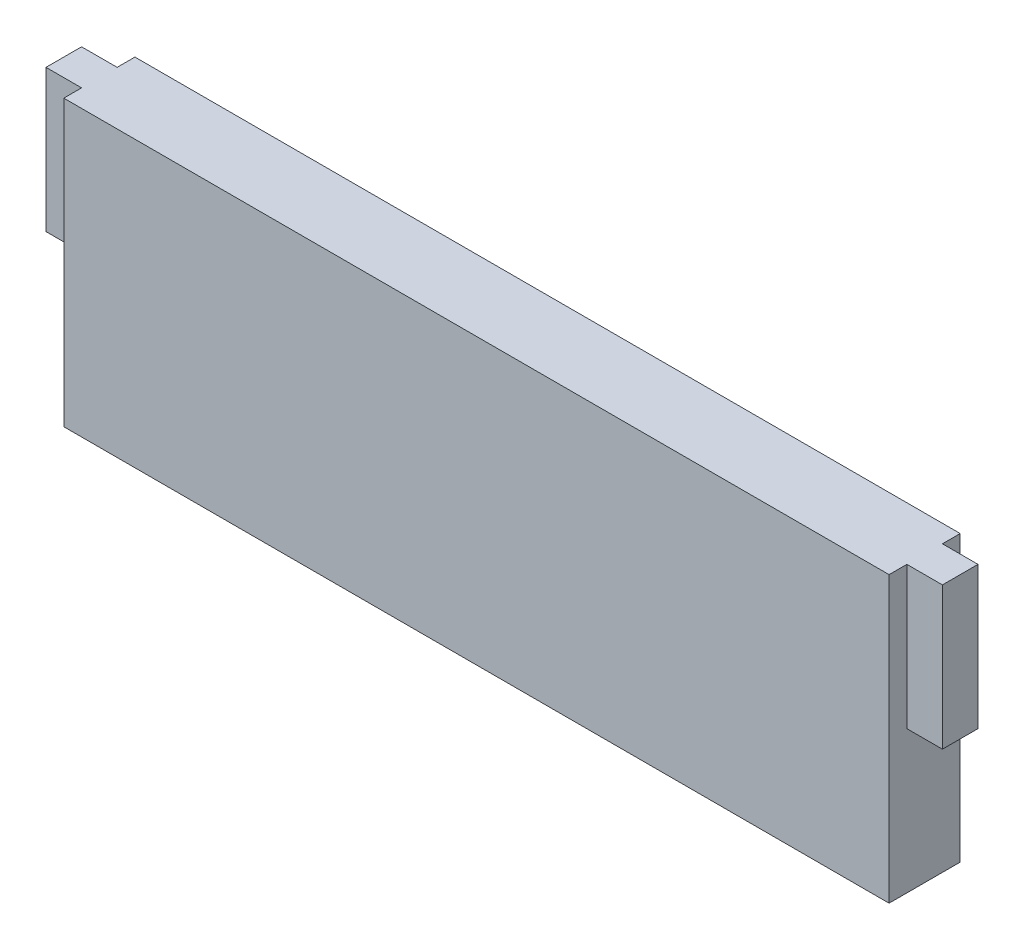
ISO-10303-21;
HEADER;
FILE_DESCRIPTION(('STEP AP214'),'2;1');
FILE_NAME('part.step','',(''),(''),'','','');
FILE_SCHEMA(('AUTOMOTIVE_DESIGN { 1 0 10303 214 1 1 1 1 }'));
ENDSEC;
DATA;
#1=APPLICATION_CONTEXT('core data for automotive mechanical design processes');
#2=APPLICATION_PROTOCOL_DEFINITION('international standard','automotive_design',2000,#1);
#3=PRODUCT_CONTEXT('',#1,'mechanical');
#4=PRODUCT('Part','Part','',(#3));
#5=PRODUCT_RELATED_PRODUCT_CATEGORY('part','',(#4));
#6=PRODUCT_DEFINITION_FORMATION('','',#4);
#7=PRODUCT_DEFINITION_CONTEXT('part definition',#1,'design');
#8=PRODUCT_DEFINITION('design','',#6,#7);
#9=PRODUCT_DEFINITION_SHAPE('','',#8);
#10=(LENGTH_UNIT() NAMED_UNIT(*) SI_UNIT(.MILLI.,.METRE.));
#11=(NAMED_UNIT(*) PLANE_ANGLE_UNIT() SI_UNIT($,.RADIAN.));
#12=(NAMED_UNIT(*) SI_UNIT($,.STERADIAN.) SOLID_ANGLE_UNIT());
#13=UNCERTAINTY_MEASURE_WITH_UNIT(LENGTH_MEASURE(1.E-05),#10,'distance_accuracy_value','');
#14=(GEOMETRIC_REPRESENTATION_CONTEXT(3) GLOBAL_UNCERTAINTY_ASSIGNED_CONTEXT((#13)) GLOBAL_UNIT_ASSIGNED_CONTEXT((#10,
#11,#12)) REPRESENTATION_CONTEXT('',''));
#15=CARTESIAN_POINT('',(0.,0.,0.));
#16=DIRECTION('',(0.,0.,1.));
#17=DIRECTION('',(1.,0.,0.));
#18=AXIS2_PLACEMENT_3D('',#15,#16,#17);
#19=CARTESIAN_POINT('',(58.,0.,-2.5));
#20=DIRECTION('',(1.,0.,0.));
#21=DIRECTION('',(0.,0.,-1.));
#22=AXIS2_PLACEMENT_3D('',#19,#20,#21);
#23=PLANE('',#22);
#24=DIRECTION('',(0.,0.,1.));
#25=VECTOR('',#24,1.);
#26=CARTESIAN_POINT('',(58.,20.212608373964,-1.25));
#27=LINE('',#26,#25);
#28=CARTESIAN_POINT('',(58.,20.212608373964,-1.25));
#29=VERTEX_POINT('',#28);
#30=CARTESIAN_POINT('',(58.,20.212608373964,1.25));
#31=VERTEX_POINT('',#30);
#32=EDGE_CURVE('E60',#29,#31,#27,.T.);
#33=ORIENTED_EDGE('',*,*,#32,.T.);
#34=DIRECTION('',(0.,1.,0.));
#35=VECTOR('',#34,1.);
#36=CARTESIAN_POINT('',(58.,0.,1.25));
#37=LINE('',#36,#35);
#38=CARTESIAN_POINT('',(58.,30.2126083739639,1.25));
#39=VERTEX_POINT('',#38);
#40=EDGE_CURVE('E159',#31,#39,#37,.T.);
#41=ORIENTED_EDGE('',*,*,#40,.T.);
#42=DIRECTION('',(0.,0.,1.));
#43=VECTOR('',#42,1.);
#44=CARTESIAN_POINT('',(58.,30.2126083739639,-2.5));
#45=LINE('',#44,#43);
#46=CARTESIAN_POINT('',(58.,30.2126083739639,2.5));
#47=VERTEX_POINT('',#46);
#48=EDGE_CURVE('E157',#39,#47,#45,.T.);
#49=ORIENTED_EDGE('',*,*,#48,.T.);
#50=DIRECTION('',(0.,1.,0.));
#51=VECTOR('',#50,1.);
#52=CARTESIAN_POINT('',(58.,0.,2.5));
#53=LINE('',#52,#51);
#54=CARTESIAN_POINT('',(58.,10.212608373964,2.5));
#55=VERTEX_POINT('',#54);
#56=EDGE_CURVE('E224',#55,#47,#53,.T.);
#57=ORIENTED_EDGE('',*,*,#56,.F.);
#58=DIRECTION('',(0.,0.,1.));
#59=VECTOR('',#58,1.);
#60=CARTESIAN_POINT('',(58.,10.212608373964,-2.5));
#61=LINE('',#60,#59);
#62=CARTESIAN_POINT('',(58.,10.212608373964,-2.5));
#63=VERTEX_POINT('',#62);
#64=EDGE_CURVE('E46',#63,#55,#61,.T.);
#65=ORIENTED_EDGE('',*,*,#64,.F.);
#66=DIRECTION('',(0.,1.,0.));
#67=VECTOR('',#66,1.);
#68=CARTESIAN_POINT('',(58.,0.,-2.5));
#69=LINE('',#68,#67);
#70=CARTESIAN_POINT('',(58.,30.2126083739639,-2.5));
#71=VERTEX_POINT('',#70);
#72=EDGE_CURVE('E239',#63,#71,#69,.T.);
#73=ORIENTED_EDGE('',*,*,#72,.T.);
#74=CARTESIAN_POINT('',(58.,30.2126083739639,-1.25));
#75=VERTEX_POINT('',#74);
#76=EDGE_CURVE('E251',#71,#75,#45,.T.);
#77=ORIENTED_EDGE('',*,*,#76,.T.);
#78=DIRECTION('',(0.,1.,0.));
#79=VECTOR('',#78,1.);
#80=CARTESIAN_POINT('',(58.,0.,-1.25));
#81=LINE('',#80,#79);
#82=EDGE_CURVE('E65',#29,#75,#81,.T.);
#83=ORIENTED_EDGE('',*,*,#82,.F.);
#84=EDGE_LOOP('',(#33,#41,#49,#57,#65,#73,#77,#83));
#85=FACE_BOUND('',#84,.T.);
#86=ADVANCED_FACE('F42',(#85),#23,.T.);
#87=CARTESIAN_POINT('',(0.,0.,-2.5));
#88=DIRECTION('',(1.,0.,0.));
#89=DIRECTION('',(0.,1.,0.));
#90=AXIS2_PLACEMENT_3D('',#87,#88,#89);
#91=PLANE('',#90);
#92=DIRECTION('',(0.,1.,0.));
#93=VECTOR('',#92,1.);
#94=CARTESIAN_POINT('',(0.,0.,1.25));
#95=LINE('',#94,#93);
#96=CARTESIAN_POINT('',(0.,20.212608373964,1.25));
#97=VERTEX_POINT('',#96);
#98=CARTESIAN_POINT('',(0.,30.212608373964,1.25));
#99=VERTEX_POINT('',#98);
#100=EDGE_CURVE('E185',#97,#99,#95,.T.);
#101=ORIENTED_EDGE('',*,*,#100,.F.);
#102=DIRECTION('',(0.,0.,1.));
#103=VECTOR('',#102,1.);
#104=CARTESIAN_POINT('',(0.,20.212608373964,-1.25));
#105=LINE('',#104,#103);
#106=CARTESIAN_POINT('',(0.,20.212608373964,-1.25));
#107=VERTEX_POINT('',#106);
#108=EDGE_CURVE('E211',#107,#97,#105,.T.);
#109=ORIENTED_EDGE('',*,*,#108,.F.);
#110=DIRECTION('',(0.,1.,0.));
#111=VECTOR('',#110,1.);
#112=CARTESIAN_POINT('',(0.,0.,-1.25));
#113=LINE('',#112,#111);
#114=CARTESIAN_POINT('',(0.,30.212608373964,-1.25));
#115=VERTEX_POINT('',#114);
#116=EDGE_CURVE('E199',#107,#115,#113,.T.);
#117=ORIENTED_EDGE('',*,*,#116,.T.);
#118=DIRECTION('',(0.,0.,1.));
#119=VECTOR('',#118,1.);
#120=CARTESIAN_POINT('',(0.,30.212608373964,-2.5));
#121=LINE('',#120,#119);
#122=CARTESIAN_POINT('',(0.,30.212608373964,-2.5));
#123=VERTEX_POINT('',#122);
#124=EDGE_CURVE('E52',#123,#115,#121,.T.);
#125=ORIENTED_EDGE('',*,*,#124,.F.);
#126=DIRECTION('',(0.,1.,0.));
#127=VECTOR('',#126,1.);
#128=CARTESIAN_POINT('',(0.,0.,-2.5));
#129=LINE('',#128,#127);
#130=CARTESIAN_POINT('',(0.,10.212608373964,-2.5));
#131=VERTEX_POINT('',#130);
#132=EDGE_CURVE('E246',#131,#123,#129,.T.);
#133=ORIENTED_EDGE('',*,*,#132,.F.);
#134=DIRECTION('',(0.,0.,1.));
#135=VECTOR('',#134,1.);
#136=CARTESIAN_POINT('',(0.,10.212608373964,-2.5));
#137=LINE('',#136,#135);
#138=CARTESIAN_POINT('',(0.,10.212608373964,2.5));
#139=VERTEX_POINT('',#138);
#140=EDGE_CURVE('E11',#131,#139,#137,.T.);
#141=ORIENTED_EDGE('',*,*,#140,.T.);
#142=DIRECTION('',(0.,1.,0.));
#143=VECTOR('',#142,1.);
#144=CARTESIAN_POINT('',(0.,0.,2.5));
#145=LINE('',#144,#143);
#146=CARTESIAN_POINT('',(0.,30.212608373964,2.5));
#147=VERTEX_POINT('',#146);
#148=EDGE_CURVE('E231',#139,#147,#145,.T.);
#149=ORIENTED_EDGE('',*,*,#148,.T.);
#150=EDGE_CURVE('E250',#99,#147,#121,.T.);
#151=ORIENTED_EDGE('',*,*,#150,.F.);
#152=EDGE_LOOP('',(#101,#109,#117,#125,#133,#141,#149,#151));
#153=FACE_BOUND('',#152,.T.);
#154=ADVANCED_FACE('F269',(#153),#91,.F.);
#155=CARTESIAN_POINT('',(0.,10.212608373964,-2.5));
#156=DIRECTION('',(0.,-1.,0.));
#157=DIRECTION('',(0.,0.,-1.));
#158=AXIS2_PLACEMENT_3D('',#155,#156,#157);
#159=PLANE('',#158);
#160=ORIENTED_EDGE('',*,*,#64,.T.);
#161=DIRECTION('',(1.,0.,0.));
#162=VECTOR('',#161,1.);
#163=CARTESIAN_POINT('',(0.,10.212608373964,2.5));
#164=LINE('',#163,#162);
#165=EDGE_CURVE('E215',#139,#55,#164,.T.);
#166=ORIENTED_EDGE('',*,*,#165,.F.);
#167=ORIENTED_EDGE('',*,*,#140,.F.);
#168=DIRECTION('',(1.,0.,0.));
#169=VECTOR('',#168,1.);
#170=CARTESIAN_POINT('',(0.,10.212608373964,-2.5));
#171=LINE('',#170,#169);
#172=EDGE_CURVE('E235',#131,#63,#171,.T.);
#173=ORIENTED_EDGE('',*,*,#172,.T.);
#174=EDGE_LOOP('',(#160,#166,#167,#173));
#175=FACE_BOUND('',#174,.T.);
#176=ADVANCED_FACE('F44',(#175),#159,.T.);
#177=CARTESIAN_POINT('',(0.,30.212608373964,-2.5));
#178=DIRECTION('',(0.,-1.,0.));
#179=DIRECTION('',(1.,0.,0.));
#180=AXIS2_PLACEMENT_3D('',#177,#178,#179);
#181=PLANE('',#180);
#182=ORIENTED_EDGE('',*,*,#124,.T.);
#183=DIRECTION('',(-1.,0.,0.));
#184=VECTOR('',#183,1.);
#185=CARTESIAN_POINT('',(0.,30.212608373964,-1.25));
#186=LINE('',#185,#184);
#187=CARTESIAN_POINT('',(-2.49999999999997,30.212608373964,-1.25));
#188=VERTEX_POINT('',#187);
#189=EDGE_CURVE('E203',#115,#188,#186,.T.);
#190=ORIENTED_EDGE('',*,*,#189,.T.);
#191=DIRECTION('',(0.,0.,1.));
#192=VECTOR('',#191,1.);
#193=CARTESIAN_POINT('',(-2.49999999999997,30.212608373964,-1.25));
#194=LINE('',#193,#192);
#195=CARTESIAN_POINT('',(-2.49999999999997,30.212608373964,1.25));
#196=VERTEX_POINT('',#195);
#197=EDGE_CURVE('E216',#188,#196,#194,.T.);
#198=ORIENTED_EDGE('',*,*,#197,.T.);
#199=DIRECTION('',(-1.,0.,0.));
#200=VECTOR('',#199,1.);
#201=CARTESIAN_POINT('',(0.,30.212608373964,1.25));
#202=LINE('',#201,#200);
#203=EDGE_CURVE('E188',#99,#196,#202,.T.);
#204=ORIENTED_EDGE('',*,*,#203,.F.);
#205=ORIENTED_EDGE('',*,*,#150,.T.);
#206=DIRECTION('',(1.,0.,0.));
#207=VECTOR('',#206,1.);
#208=CARTESIAN_POINT('',(0.,30.212608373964,2.5));
#209=LINE('',#208,#207);
#210=EDGE_CURVE('E228',#147,#47,#209,.T.);
#211=ORIENTED_EDGE('',*,*,#210,.T.);
#212=ORIENTED_EDGE('',*,*,#48,.F.);
#213=DIRECTION('',(1.,0.,0.));
#214=VECTOR('',#213,1.);
#215=CARTESIAN_POINT('',(-6.70854669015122E-13,30.2126083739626,1.25));
#216=LINE('',#215,#214);
#217=CARTESIAN_POINT('',(60.5,30.212608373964,1.25));
#218=VERTEX_POINT('',#217);
#219=EDGE_CURVE('E149',#39,#218,#216,.T.);
#220=ORIENTED_EDGE('',*,*,#219,.T.);
#221=DIRECTION('',(0.,0.,1.));
#222=VECTOR('',#221,1.);
#223=CARTESIAN_POINT('',(60.5,30.212608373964,-1.25));
#224=LINE('',#223,#222);
#225=CARTESIAN_POINT('',(60.5,30.212608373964,-1.25));
#226=VERTEX_POINT('',#225);
#227=EDGE_CURVE('E132',#226,#218,#224,.T.);
#228=ORIENTED_EDGE('',*,*,#227,.F.);
#229=DIRECTION('',(1.,0.,0.));
#230=VECTOR('',#229,1.);
#231=CARTESIAN_POINT('',(-6.70854669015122E-13,30.2126083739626,-1.25));
#232=LINE('',#231,#230);
#233=EDGE_CURVE('E168',#75,#226,#232,.T.);
#234=ORIENTED_EDGE('',*,*,#233,.F.);
#235=ORIENTED_EDGE('',*,*,#76,.F.);
#236=DIRECTION('',(1.,0.,0.));
#237=VECTOR('',#236,1.);
#238=CARTESIAN_POINT('',(0.,30.212608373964,-2.5));
#239=LINE('',#238,#237);
#240=EDGE_CURVE('E243',#123,#71,#239,.T.);
#241=ORIENTED_EDGE('',*,*,#240,.F.);
#242=EDGE_LOOP('',(#182,#190,#198,#204,#205,#211,#212,#220,#228,#234,#235,#241));
#243=FACE_BOUND('',#242,.T.);
#244=ADVANCED_FACE('F155',(#243),#181,.F.);
#245=CARTESIAN_POINT('',(0.,0.,-2.5));
#246=DIRECTION('',(0.,0.,1.));
#247=DIRECTION('',(1.,0.,0.));
#248=AXIS2_PLACEMENT_3D('',#245,#246,#247);
#249=PLANE('',#248);
#250=ORIENTED_EDGE('',*,*,#172,.F.);
#251=ORIENTED_EDGE('',*,*,#132,.T.);
#252=ORIENTED_EDGE('',*,*,#240,.T.);
#253=ORIENTED_EDGE('',*,*,#72,.F.);
#254=EDGE_LOOP('',(#250,#251,#252,#253));
#255=FACE_BOUND('',#254,.T.);
#256=ADVANCED_FACE('F274',(#255),#249,.F.);
#257=CARTESIAN_POINT('',(0.,0.,2.5));
#258=DIRECTION('',(0.,0.,1.));
#259=DIRECTION('',(1.,0.,0.));
#260=AXIS2_PLACEMENT_3D('',#257,#258,#259);
#261=PLANE('',#260);
#262=ORIENTED_EDGE('',*,*,#165,.T.);
#263=ORIENTED_EDGE('',*,*,#56,.T.);
#264=ORIENTED_EDGE('',*,*,#210,.F.);
#265=ORIENTED_EDGE('',*,*,#148,.F.);
#266=EDGE_LOOP('',(#262,#263,#264,#265));
#267=FACE_BOUND('',#266,.T.);
#268=ADVANCED_FACE('F265',(#267),#261,.T.);
#269=CARTESIAN_POINT('',(0.,20.212608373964,-1.25));
#270=DIRECTION('',(0.,1.,0.));
#271=DIRECTION('',(0.,0.,1.));
#272=AXIS2_PLACEMENT_3D('',#269,#270,#271);
#273=PLANE('',#272);
#274=ORIENTED_EDGE('',*,*,#108,.T.);
#275=DIRECTION('',(-1.,0.,0.));
#276=VECTOR('',#275,1.);
#277=CARTESIAN_POINT('',(0.,20.212608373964,1.25));
#278=LINE('',#277,#276);
#279=CARTESIAN_POINT('',(-2.5,20.212608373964,1.25));
#280=VERTEX_POINT('',#279);
#281=EDGE_CURVE('E179',#97,#280,#278,.T.);
#282=ORIENTED_EDGE('',*,*,#281,.T.);
#283=DIRECTION('',(0.,0.,1.));
#284=VECTOR('',#283,1.);
#285=CARTESIAN_POINT('',(-2.5,20.212608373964,-1.25));
#286=LINE('',#285,#284);
#287=CARTESIAN_POINT('',(-2.5,20.212608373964,-1.25));
#288=VERTEX_POINT('',#287);
#289=EDGE_CURVE('E212',#288,#280,#286,.T.);
#290=ORIENTED_EDGE('',*,*,#289,.F.);
#291=DIRECTION('',(-1.,0.,0.));
#292=VECTOR('',#291,1.);
#293=CARTESIAN_POINT('',(0.,20.212608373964,-1.25));
#294=LINE('',#293,#292);
#295=EDGE_CURVE('E196',#107,#288,#294,.T.);
#296=ORIENTED_EDGE('',*,*,#295,.F.);
#297=EDGE_LOOP('',(#274,#282,#290,#296));
#298=FACE_BOUND('',#297,.T.);
#299=ADVANCED_FACE('F301',(#298),#273,.F.);
#300=CARTESIAN_POINT('',(-2.50000000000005,0.,-1.25));
#301=DIRECTION('',(-1.,0.,0.));
#302=DIRECTION('',(0.,-1.,0.));
#303=AXIS2_PLACEMENT_3D('',#300,#301,#302);
#304=PLANE('',#303);
#305=ORIENTED_EDGE('',*,*,#289,.T.);
#306=DIRECTION('',(0.,-1.,0.));
#307=VECTOR('',#306,1.);
#308=CARTESIAN_POINT('',(-2.50000000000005,0.,1.25));
#309=LINE('',#308,#307);
#310=EDGE_CURVE('E192',#196,#280,#309,.T.);
#311=ORIENTED_EDGE('',*,*,#310,.F.);
#312=ORIENTED_EDGE('',*,*,#197,.F.);
#313=DIRECTION('',(0.,-1.,0.));
#314=VECTOR('',#313,1.);
#315=CARTESIAN_POINT('',(-2.50000000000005,0.,-1.25));
#316=LINE('',#315,#314);
#317=EDGE_CURVE('E207',#188,#288,#316,.T.);
#318=ORIENTED_EDGE('',*,*,#317,.T.);
#319=EDGE_LOOP('',(#305,#311,#312,#318));
#320=FACE_BOUND('',#319,.T.);
#321=ADVANCED_FACE('F304',(#320),#304,.T.);
#322=CARTESIAN_POINT('',(0.,0.,-1.25));
#323=DIRECTION('',(0.,0.,1.));
#324=DIRECTION('',(1.,0.,0.));
#325=AXIS2_PLACEMENT_3D('',#322,#323,#324);
#326=PLANE('',#325);
#327=ORIENTED_EDGE('',*,*,#295,.T.);
#328=ORIENTED_EDGE('',*,*,#317,.F.);
#329=ORIENTED_EDGE('',*,*,#189,.F.);
#330=ORIENTED_EDGE('',*,*,#116,.F.);
#331=EDGE_LOOP('',(#327,#328,#329,#330));
#332=FACE_BOUND('',#331,.T.);
#333=ADVANCED_FACE('F308',(#332),#326,.F.);
#334=CARTESIAN_POINT('',(0.,0.,1.25));
#335=DIRECTION('',(0.,0.,1.));
#336=DIRECTION('',(1.,0.,0.));
#337=AXIS2_PLACEMENT_3D('',#334,#335,#336);
#338=PLANE('',#337);
#339=ORIENTED_EDGE('',*,*,#281,.F.);
#340=ORIENTED_EDGE('',*,*,#100,.T.);
#341=ORIENTED_EDGE('',*,*,#203,.T.);
#342=ORIENTED_EDGE('',*,*,#310,.T.);
#343=EDGE_LOOP('',(#339,#340,#341,#342));
#344=FACE_BOUND('',#343,.T.);
#345=ADVANCED_FACE('F287',(#344),#338,.T.);
#346=CARTESIAN_POINT('',(60.5000000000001,1.67921232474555E-13,-1.25));
#347=DIRECTION('',(-1.,0.,0.));
#348=DIRECTION('',(0.,-1.,0.));
#349=AXIS2_PLACEMENT_3D('',#346,#347,#348);
#350=PLANE('',#349);
#351=ORIENTED_EDGE('',*,*,#227,.T.);
#352=DIRECTION('',(0.,-1.,0.));
#353=VECTOR('',#352,1.);
#354=CARTESIAN_POINT('',(60.5000000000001,1.67921232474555E-13,1.25));
#355=LINE('',#354,#353);
#356=CARTESIAN_POINT('',(60.5,20.212608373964,1.25));
#357=VERTEX_POINT('',#356);
#358=EDGE_CURVE('E136',#218,#357,#355,.T.);
#359=ORIENTED_EDGE('',*,*,#358,.T.);
#360=DIRECTION('',(0.,0.,1.));
#361=VECTOR('',#360,1.);
#362=CARTESIAN_POINT('',(60.5,20.212608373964,-1.25));
#363=LINE('',#362,#361);
#364=CARTESIAN_POINT('',(60.5,20.212608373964,-1.25));
#365=VERTEX_POINT('',#364);
#366=EDGE_CURVE('E176',#365,#357,#363,.T.);
#367=ORIENTED_EDGE('',*,*,#366,.F.);
#368=DIRECTION('',(0.,-1.,0.));
#369=VECTOR('',#368,1.);
#370=CARTESIAN_POINT('',(60.5000000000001,1.67921232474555E-13,-1.25));
#371=LINE('',#370,#369);
#372=EDGE_CURVE('E137',#226,#365,#371,.T.);
#373=ORIENTED_EDGE('',*,*,#372,.F.);
#374=EDGE_LOOP('',(#351,#359,#367,#373));
#375=FACE_BOUND('',#374,.T.);
#376=ADVANCED_FACE('F134',(#375),#350,.F.);
#377=CARTESIAN_POINT('',(0.,20.212608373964,-1.25));
#378=DIRECTION('',(0.,-1.,0.));
#379=DIRECTION('',(0.,0.,-1.));
#380=AXIS2_PLACEMENT_3D('',#377,#378,#379);
#381=PLANE('',#380);
#382=ORIENTED_EDGE('',*,*,#366,.T.);
#383=DIRECTION('',(1.,0.,0.));
#384=VECTOR('',#383,1.);
#385=CARTESIAN_POINT('',(0.,20.212608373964,1.25));
#386=LINE('',#385,#384);
#387=EDGE_CURVE('E150',#31,#357,#386,.T.);
#388=ORIENTED_EDGE('',*,*,#387,.F.);
#389=ORIENTED_EDGE('',*,*,#32,.F.);
#390=DIRECTION('',(1.,0.,0.));
#391=VECTOR('',#390,1.);
#392=CARTESIAN_POINT('',(0.,20.212608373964,-1.25));
#393=LINE('',#392,#391);
#394=EDGE_CURVE('E142',#29,#365,#393,.T.);
#395=ORIENTED_EDGE('',*,*,#394,.T.);
#396=EDGE_LOOP('',(#382,#388,#389,#395));
#397=FACE_BOUND('',#396,.T.);
#398=ADVANCED_FACE('F279',(#397),#381,.T.);
#399=CARTESIAN_POINT('',(0.,0.,-1.25));
#400=DIRECTION('',(0.,0.,1.));
#401=DIRECTION('',(1.,0.,0.));
#402=AXIS2_PLACEMENT_3D('',#399,#400,#401);
#403=PLANE('',#402);
#404=ORIENTED_EDGE('',*,*,#372,.T.);
#405=ORIENTED_EDGE('',*,*,#394,.F.);
#406=ORIENTED_EDGE('',*,*,#82,.T.);
#407=ORIENTED_EDGE('',*,*,#233,.T.);
#408=EDGE_LOOP('',(#404,#405,#406,#407));
#409=FACE_BOUND('',#408,.T.);
#410=ADVANCED_FACE('F276',(#409),#403,.F.);
#411=CARTESIAN_POINT('',(0.,0.,1.25));
#412=DIRECTION('',(0.,0.,1.));
#413=DIRECTION('',(1.,0.,0.));
#414=AXIS2_PLACEMENT_3D('',#411,#412,#413);
#415=PLANE('',#414);
#416=ORIENTED_EDGE('',*,*,#358,.F.);
#417=ORIENTED_EDGE('',*,*,#219,.F.);
#418=ORIENTED_EDGE('',*,*,#40,.F.);
#419=ORIENTED_EDGE('',*,*,#387,.T.);
#420=EDGE_LOOP('',(#416,#417,#418,#419));
#421=FACE_BOUND('',#420,.T.);
#422=ADVANCED_FACE('F147',(#421),#415,.T.);
#423=CLOSED_SHELL('',(#86,#154,#176,#244,#256,#268,#299,#321,#333,#345,#376,#398,#410,#422));
#424=MANIFOLD_SOLID_BREP('B2',#423);
#425=ADVANCED_BREP_SHAPE_REPRESENTATION('',(#18,#424),#14);
#426=SHAPE_DEFINITION_REPRESENTATION(#9,#425);
ENDSEC;
END-ISO-10303-21;
